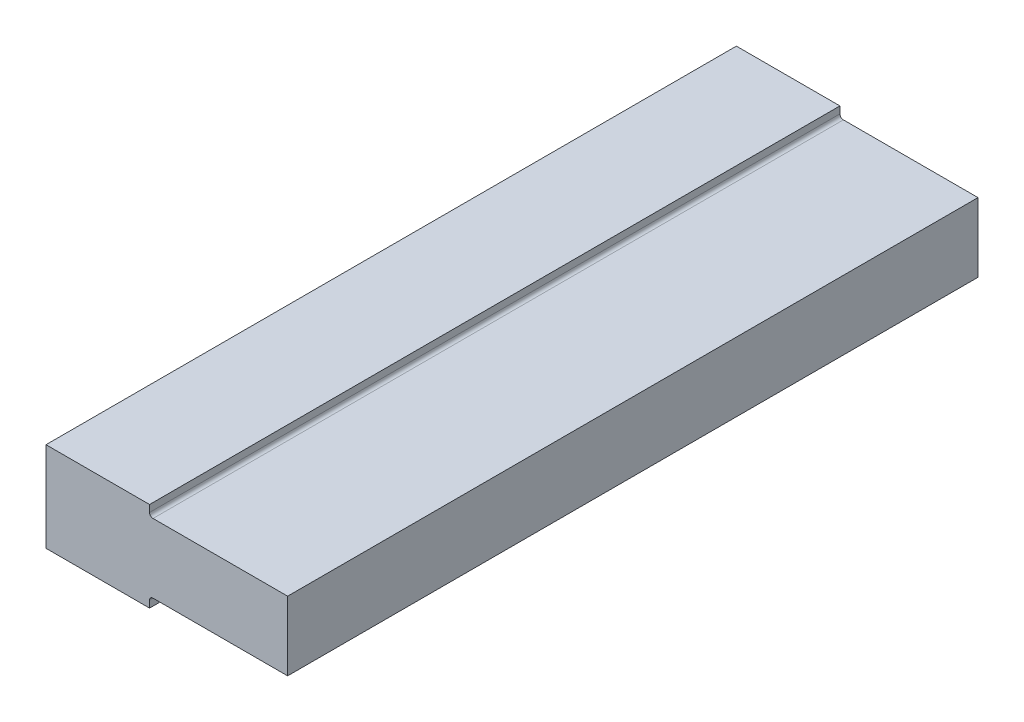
ISO-10303-21;
HEADER;
FILE_DESCRIPTION(('STEP AP214'),'2;1');
FILE_NAME('part.step','',(''),(''),'','','');
FILE_SCHEMA(('AUTOMOTIVE_DESIGN { 1 0 10303 214 1 1 1 1 }'));
ENDSEC;
DATA;
#1=APPLICATION_CONTEXT('core data for automotive mechanical design processes');
#2=APPLICATION_PROTOCOL_DEFINITION('international standard','automotive_design',2000,#1);
#3=PRODUCT_CONTEXT('',#1,'mechanical');
#4=PRODUCT('Part','Part','',(#3));
#5=PRODUCT_RELATED_PRODUCT_CATEGORY('part','',(#4));
#6=PRODUCT_DEFINITION_FORMATION('','',#4);
#7=PRODUCT_DEFINITION_CONTEXT('part definition',#1,'design');
#8=PRODUCT_DEFINITION('design','',#6,#7);
#9=PRODUCT_DEFINITION_SHAPE('','',#8);
#10=(LENGTH_UNIT() NAMED_UNIT(*) SI_UNIT(.MILLI.,.METRE.));
#11=(NAMED_UNIT(*) PLANE_ANGLE_UNIT() SI_UNIT($,.RADIAN.));
#12=(NAMED_UNIT(*) SI_UNIT($,.STERADIAN.) SOLID_ANGLE_UNIT());
#13=UNCERTAINTY_MEASURE_WITH_UNIT(LENGTH_MEASURE(1.E-05),#10,'distance_accuracy_value','');
#14=(GEOMETRIC_REPRESENTATION_CONTEXT(3) GLOBAL_UNCERTAINTY_ASSIGNED_CONTEXT((#13)) GLOBAL_UNIT_ASSIGNED_CONTEXT((#10,
#11,#12)) REPRESENTATION_CONTEXT('',''));
#15=CARTESIAN_POINT('',(0.,0.,0.));
#16=DIRECTION('',(0.,0.,1.));
#17=DIRECTION('',(1.,0.,0.));
#18=AXIS2_PLACEMENT_3D('',#15,#16,#17);
#19=CARTESIAN_POINT('',(0.,-6.50000000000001,100.));
#20=DIRECTION('',(0.,1.,0.));
#21=DIRECTION('',(0.,0.,1.));
#22=AXIS2_PLACEMENT_3D('',#19,#20,#21);
#23=PLANE('',#22);
#24=DIRECTION('',(1.,0.,0.));
#25=VECTOR('',#24,1.);
#26=CARTESIAN_POINT('',(0.,-6.50000000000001,0.));
#27=LINE('',#26,#25);
#28=CARTESIAN_POINT('',(0.,-6.50000000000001,0.));
#29=VERTEX_POINT('',#28);
#30=CARTESIAN_POINT('',(15.,-6.50000000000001,0.));
#31=VERTEX_POINT('',#30);
#32=EDGE_CURVE('E147',#29,#31,#27,.T.);
#33=ORIENTED_EDGE('',*,*,#32,.T.);
#34=DIRECTION('',(0.,0.,-1.));
#35=VECTOR('',#34,1.);
#36=CARTESIAN_POINT('',(15.,-6.50000000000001,100.));
#37=LINE('',#36,#35);
#38=CARTESIAN_POINT('',(15.,-6.50000000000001,100.));
#39=VERTEX_POINT('',#38);
#40=EDGE_CURVE('E12',#39,#31,#37,.T.);
#41=ORIENTED_EDGE('',*,*,#40,.F.);
#42=DIRECTION('',(1.,0.,0.));
#43=VECTOR('',#42,1.);
#44=CARTESIAN_POINT('',(0.,-6.50000000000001,100.));
#45=LINE('',#44,#43);
#46=CARTESIAN_POINT('',(0.,-6.50000000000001,100.));
#47=VERTEX_POINT('',#46);
#48=EDGE_CURVE('E165',#47,#39,#45,.T.);
#49=ORIENTED_EDGE('',*,*,#48,.F.);
#50=DIRECTION('',(0.,0.,-1.));
#51=VECTOR('',#50,1.);
#52=CARTESIAN_POINT('',(0.,-6.50000000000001,100.));
#53=LINE('',#52,#51);
#54=EDGE_CURVE('E143',#47,#29,#53,.T.);
#55=ORIENTED_EDGE('',*,*,#54,.T.);
#56=EDGE_LOOP('',(#33,#41,#49,#55));
#57=FACE_BOUND('',#56,.T.);
#58=ADVANCED_FACE('F39',(#57),#23,.F.);
#59=CARTESIAN_POINT('',(15.,-6.50000000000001,100.));
#60=DIRECTION('',(-1.,0.,0.));
#61=DIRECTION('',(0.,0.,1.));
#62=AXIS2_PLACEMENT_3D('',#59,#60,#61);
#63=PLANE('',#62);
#64=DIRECTION('',(0.,1.,0.));
#65=VECTOR('',#64,1.);
#66=CARTESIAN_POINT('',(15.,-6.50000000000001,0.));
#67=LINE('',#66,#65);
#68=CARTESIAN_POINT('',(15.,-5.5,0.));
#69=VERTEX_POINT('',#68);
#70=EDGE_CURVE('E150',#31,#69,#67,.T.);
#71=ORIENTED_EDGE('',*,*,#70,.T.);
#72=DIRECTION('',(0.,0.,-1.));
#73=VECTOR('',#72,1.);
#74=CARTESIAN_POINT('',(15.,-5.5,100.));
#75=LINE('',#74,#73);
#76=CARTESIAN_POINT('',(15.,-5.5,100.));
#77=VERTEX_POINT('',#76);
#78=EDGE_CURVE('E47',#77,#69,#75,.T.);
#79=ORIENTED_EDGE('',*,*,#78,.F.);
#80=DIRECTION('',(0.,1.,0.));
#81=VECTOR('',#80,1.);
#82=CARTESIAN_POINT('',(15.,-6.50000000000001,100.));
#83=LINE('',#82,#81);
#84=EDGE_CURVE('E104',#39,#77,#83,.T.);
#85=ORIENTED_EDGE('',*,*,#84,.F.);
#86=ORIENTED_EDGE('',*,*,#40,.T.);
#87=EDGE_LOOP('',(#71,#79,#85,#86));
#88=FACE_BOUND('',#87,.T.);
#89=ADVANCED_FACE('F187',(#88),#63,.F.);
#90=CARTESIAN_POINT('',(15.5,-5.5,100.));
#91=DIRECTION('',(0.,0.,-1.));
#92=DIRECTION('',(-1.,0.,0.));
#93=AXIS2_PLACEMENT_3D('',#90,#91,#92);
#94=CYLINDRICAL_SURFACE('',#93,0.5);
#95=CARTESIAN_POINT('',(15.5,-5.5,0.));
#96=DIRECTION('',(0.,0.,-1.));
#97=DIRECTION('',(1.,0.,0.));
#98=AXIS2_PLACEMENT_3D('',#95,#96,#97);
#99=CIRCLE('',#98,0.5);
#100=CARTESIAN_POINT('',(15.5,-5.,0.));
#101=VERTEX_POINT('',#100);
#102=EDGE_CURVE('E152',#69,#101,#99,.T.);
#103=ORIENTED_EDGE('',*,*,#102,.T.);
#104=DIRECTION('',(0.,0.,-1.));
#105=VECTOR('',#104,1.);
#106=CARTESIAN_POINT('',(15.5,-5.,100.));
#107=LINE('',#106,#105);
#108=CARTESIAN_POINT('',(15.5,-5.,100.));
#109=VERTEX_POINT('',#108);
#110=EDGE_CURVE('E196',#109,#101,#107,.T.);
#111=ORIENTED_EDGE('',*,*,#110,.F.);
#112=CARTESIAN_POINT('',(15.5,-5.5,100.));
#113=DIRECTION('',(0.,0.,-1.));
#114=DIRECTION('',(1.,0.,0.));
#115=AXIS2_PLACEMENT_3D('',#112,#113,#114);
#116=CIRCLE('',#115,0.5);
#117=EDGE_CURVE('E180',#77,#109,#116,.T.);
#118=ORIENTED_EDGE('',*,*,#117,.F.);
#119=ORIENTED_EDGE('',*,*,#78,.T.);
#120=EDGE_LOOP('',(#103,#111,#118,#119));
#121=FACE_BOUND('',#120,.T.);
#122=ADVANCED_FACE('F193',(#121),#94,.F.);
#123=CARTESIAN_POINT('',(15.5,-5.,100.));
#124=DIRECTION('',(0.,1.,0.));
#125=DIRECTION('',(0.,0.,1.));
#126=AXIS2_PLACEMENT_3D('',#123,#124,#125);
#127=PLANE('',#126);
#128=DIRECTION('',(1.,0.,0.));
#129=VECTOR('',#128,1.);
#130=CARTESIAN_POINT('',(15.5,-5.,0.));
#131=LINE('',#130,#129);
#132=CARTESIAN_POINT('',(35.,-5.,0.));
#133=VERTEX_POINT('',#132);
#134=EDGE_CURVE('E154',#101,#133,#131,.T.);
#135=ORIENTED_EDGE('',*,*,#134,.T.);
#136=DIRECTION('',(0.,0.,-1.));
#137=VECTOR('',#136,1.);
#138=CARTESIAN_POINT('',(35.,-5.,100.));
#139=LINE('',#138,#137);
#140=CARTESIAN_POINT('',(35.,-5.,100.));
#141=VERTEX_POINT('',#140);
#142=EDGE_CURVE('E206',#141,#133,#139,.T.);
#143=ORIENTED_EDGE('',*,*,#142,.F.);
#144=DIRECTION('',(1.,0.,0.));
#145=VECTOR('',#144,1.);
#146=CARTESIAN_POINT('',(15.5,-5.,100.));
#147=LINE('',#146,#145);
#148=EDGE_CURVE('E178',#109,#141,#147,.T.);
#149=ORIENTED_EDGE('',*,*,#148,.F.);
#150=ORIENTED_EDGE('',*,*,#110,.T.);
#151=EDGE_LOOP('',(#135,#143,#149,#150));
#152=FACE_BOUND('',#151,.T.);
#153=ADVANCED_FACE('F204',(#152),#127,.F.);
#154=CARTESIAN_POINT('',(35.,-5.,100.));
#155=DIRECTION('',(-1.,0.,0.));
#156=DIRECTION('',(0.,0.,1.));
#157=AXIS2_PLACEMENT_3D('',#154,#155,#156);
#158=PLANE('',#157);
#159=DIRECTION('',(0.,1.,0.));
#160=VECTOR('',#159,1.);
#161=CARTESIAN_POINT('',(35.,-5.,0.));
#162=LINE('',#161,#160);
#163=CARTESIAN_POINT('',(35.,5.,0.));
#164=VERTEX_POINT('',#163);
#165=EDGE_CURVE('E156',#133,#164,#162,.T.);
#166=ORIENTED_EDGE('',*,*,#165,.T.);
#167=DIRECTION('',(0.,0.,-1.));
#168=VECTOR('',#167,1.);
#169=CARTESIAN_POINT('',(35.,5.,100.));
#170=LINE('',#169,#168);
#171=CARTESIAN_POINT('',(35.,5.,100.));
#172=VERTEX_POINT('',#171);
#173=EDGE_CURVE('E212',#172,#164,#170,.T.);
#174=ORIENTED_EDGE('',*,*,#173,.F.);
#175=DIRECTION('',(0.,1.,0.));
#176=VECTOR('',#175,1.);
#177=CARTESIAN_POINT('',(35.,-5.,100.));
#178=LINE('',#177,#176);
#179=EDGE_CURVE('E176',#141,#172,#178,.T.);
#180=ORIENTED_EDGE('',*,*,#179,.F.);
#181=ORIENTED_EDGE('',*,*,#142,.T.);
#182=EDGE_LOOP('',(#166,#174,#180,#181));
#183=FACE_BOUND('',#182,.T.);
#184=ADVANCED_FACE('F209',(#183),#158,.F.);
#185=CARTESIAN_POINT('',(15.5,5.,100.));
#186=DIRECTION('',(0.,-1.,0.));
#187=DIRECTION('',(0.,0.,-1.));
#188=AXIS2_PLACEMENT_3D('',#185,#186,#187);
#189=PLANE('',#188);
#190=DIRECTION('',(-1.,0.,0.));
#191=VECTOR('',#190,1.);
#192=CARTESIAN_POINT('',(15.5,5.,0.));
#193=LINE('',#192,#191);
#194=CARTESIAN_POINT('',(15.5,5.,0.));
#195=VERTEX_POINT('',#194);
#196=EDGE_CURVE('E158',#164,#195,#193,.T.);
#197=ORIENTED_EDGE('',*,*,#196,.T.);
#198=DIRECTION('',(0.,0.,-1.));
#199=VECTOR('',#198,1.);
#200=CARTESIAN_POINT('',(15.5,5.,100.));
#201=LINE('',#200,#199);
#202=CARTESIAN_POINT('',(15.5,5.,100.));
#203=VERTEX_POINT('',#202);
#204=EDGE_CURVE('E214',#203,#195,#201,.T.);
#205=ORIENTED_EDGE('',*,*,#204,.F.);
#206=DIRECTION('',(-1.,0.,0.));
#207=VECTOR('',#206,1.);
#208=CARTESIAN_POINT('',(15.5,5.,100.));
#209=LINE('',#208,#207);
#210=EDGE_CURVE('E173',#172,#203,#209,.T.);
#211=ORIENTED_EDGE('',*,*,#210,.F.);
#212=ORIENTED_EDGE('',*,*,#173,.T.);
#213=EDGE_LOOP('',(#197,#205,#211,#212));
#214=FACE_BOUND('',#213,.T.);
#215=ADVANCED_FACE('F225',(#214),#189,.F.);
#216=CARTESIAN_POINT('',(15.5,5.5,100.));
#217=DIRECTION('',(0.,0.,-1.));
#218=DIRECTION('',(-1.,0.,0.));
#219=AXIS2_PLACEMENT_3D('',#216,#217,#218);
#220=CYLINDRICAL_SURFACE('',#219,0.5);
#221=CARTESIAN_POINT('',(15.5,5.5,0.));
#222=DIRECTION('',(0.,0.,-1.));
#223=DIRECTION('',(-1.,0.,0.));
#224=AXIS2_PLACEMENT_3D('',#221,#222,#223);
#225=CIRCLE('',#224,0.5);
#226=CARTESIAN_POINT('',(15.,5.5,0.));
#227=VERTEX_POINT('',#226);
#228=EDGE_CURVE('E160',#195,#227,#225,.T.);
#229=ORIENTED_EDGE('',*,*,#228,.T.);
#230=DIRECTION('',(0.,0.,-1.));
#231=VECTOR('',#230,1.);
#232=CARTESIAN_POINT('',(15.,5.5,100.));
#233=LINE('',#232,#231);
#234=CARTESIAN_POINT('',(15.,5.5,100.));
#235=VERTEX_POINT('',#234);
#236=EDGE_CURVE('E138',#235,#227,#233,.T.);
#237=ORIENTED_EDGE('',*,*,#236,.F.);
#238=CARTESIAN_POINT('',(15.5,5.5,100.));
#239=DIRECTION('',(0.,0.,-1.));
#240=DIRECTION('',(-1.,0.,0.));
#241=AXIS2_PLACEMENT_3D('',#238,#239,#240);
#242=CIRCLE('',#241,0.5);
#243=EDGE_CURVE('E129',#203,#235,#242,.T.);
#244=ORIENTED_EDGE('',*,*,#243,.F.);
#245=ORIENTED_EDGE('',*,*,#204,.T.);
#246=EDGE_LOOP('',(#229,#237,#244,#245));
#247=FACE_BOUND('',#246,.T.);
#248=ADVANCED_FACE('F221',(#247),#220,.F.);
#249=CARTESIAN_POINT('',(15.,6.5,100.));
#250=DIRECTION('',(-1.,0.,0.));
#251=DIRECTION('',(0.,0.,1.));
#252=AXIS2_PLACEMENT_3D('',#249,#250,#251);
#253=PLANE('',#252);
#254=DIRECTION('',(0.,1.,0.));
#255=VECTOR('',#254,1.);
#256=CARTESIAN_POINT('',(15.,6.5,0.));
#257=LINE('',#256,#255);
#258=CARTESIAN_POINT('',(15.,6.5,0.));
#259=VERTEX_POINT('',#258);
#260=EDGE_CURVE('E137',#227,#259,#257,.T.);
#261=ORIENTED_EDGE('',*,*,#260,.T.);
#262=DIRECTION('',(0.,0.,-1.));
#263=VECTOR('',#262,1.);
#264=CARTESIAN_POINT('',(15.,6.5,100.));
#265=LINE('',#264,#263);
#266=CARTESIAN_POINT('',(15.,6.5,100.));
#267=VERTEX_POINT('',#266);
#268=EDGE_CURVE('E134',#267,#259,#265,.T.);
#269=ORIENTED_EDGE('',*,*,#268,.F.);
#270=DIRECTION('',(0.,1.,0.));
#271=VECTOR('',#270,1.);
#272=CARTESIAN_POINT('',(15.,6.5,100.));
#273=LINE('',#272,#271);
#274=EDGE_CURVE('E123',#235,#267,#273,.T.);
#275=ORIENTED_EDGE('',*,*,#274,.F.);
#276=ORIENTED_EDGE('',*,*,#236,.T.);
#277=EDGE_LOOP('',(#261,#269,#275,#276));
#278=FACE_BOUND('',#277,.T.);
#279=ADVANCED_FACE('F135',(#278),#253,.F.);
#280=CARTESIAN_POINT('',(0.,6.5,100.));
#281=DIRECTION('',(0.,-1.,0.));
#282=DIRECTION('',(0.,0.,-1.));
#283=AXIS2_PLACEMENT_3D('',#280,#281,#282);
#284=PLANE('',#283);
#285=DIRECTION('',(-1.,0.,0.));
#286=VECTOR('',#285,1.);
#287=CARTESIAN_POINT('',(0.,6.5,0.));
#288=LINE('',#287,#286);
#289=CARTESIAN_POINT('',(0.,6.5,0.));
#290=VERTEX_POINT('',#289);
#291=EDGE_CURVE('E90',#259,#290,#288,.T.);
#292=ORIENTED_EDGE('',*,*,#291,.T.);
#293=DIRECTION('',(0.,0.,-1.));
#294=VECTOR('',#293,1.);
#295=CARTESIAN_POINT('',(0.,6.5,100.));
#296=LINE('',#295,#294);
#297=CARTESIAN_POINT('',(0.,6.5,100.));
#298=VERTEX_POINT('',#297);
#299=EDGE_CURVE('E139',#298,#290,#296,.T.);
#300=ORIENTED_EDGE('',*,*,#299,.F.);
#301=DIRECTION('',(-1.,0.,0.));
#302=VECTOR('',#301,1.);
#303=CARTESIAN_POINT('',(0.,6.5,100.));
#304=LINE('',#303,#302);
#305=EDGE_CURVE('E127',#267,#298,#304,.T.);
#306=ORIENTED_EDGE('',*,*,#305,.F.);
#307=ORIENTED_EDGE('',*,*,#268,.T.);
#308=EDGE_LOOP('',(#292,#300,#306,#307));
#309=FACE_BOUND('',#308,.T.);
#310=ADVANCED_FACE('F141',(#309),#284,.F.);
#311=CARTESIAN_POINT('',(0.,-6.50000000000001,100.));
#312=DIRECTION('',(1.,0.,0.));
#313=DIRECTION('',(0.,0.,-1.));
#314=AXIS2_PLACEMENT_3D('',#311,#312,#313);
#315=PLANE('',#314);
#316=DIRECTION('',(0.,-1.,0.));
#317=VECTOR('',#316,1.);
#318=CARTESIAN_POINT('',(0.,-6.50000000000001,0.));
#319=LINE('',#318,#317);
#320=EDGE_CURVE('E96',#290,#29,#319,.T.);
#321=ORIENTED_EDGE('',*,*,#320,.T.);
#322=ORIENTED_EDGE('',*,*,#54,.F.);
#323=DIRECTION('',(0.,-1.,0.));
#324=VECTOR('',#323,1.);
#325=CARTESIAN_POINT('',(0.,-6.50000000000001,100.));
#326=LINE('',#325,#324);
#327=EDGE_CURVE('E55',#298,#47,#326,.T.);
#328=ORIENTED_EDGE('',*,*,#327,.F.);
#329=ORIENTED_EDGE('',*,*,#299,.T.);
#330=EDGE_LOOP('',(#321,#322,#328,#329));
#331=FACE_BOUND('',#330,.T.);
#332=ADVANCED_FACE('F279',(#331),#315,.F.);
#333=CARTESIAN_POINT('',(15.5,-5.5,100.));
#334=DIRECTION('',(0.,0.,1.));
#335=DIRECTION('',(1.,0.,0.));
#336=AXIS2_PLACEMENT_3D('',#333,#334,#335);
#337=PLANE('',#336);
#338=ORIENTED_EDGE('',*,*,#48,.T.);
#339=ORIENTED_EDGE('',*,*,#84,.T.);
#340=ORIENTED_EDGE('',*,*,#117,.T.);
#341=ORIENTED_EDGE('',*,*,#148,.T.);
#342=ORIENTED_EDGE('',*,*,#179,.T.);
#343=ORIENTED_EDGE('',*,*,#210,.T.);
#344=ORIENTED_EDGE('',*,*,#243,.T.);
#345=ORIENTED_EDGE('',*,*,#274,.T.);
#346=ORIENTED_EDGE('',*,*,#305,.T.);
#347=ORIENTED_EDGE('',*,*,#327,.T.);
#348=EDGE_LOOP('',(#338,#339,#340,#341,#342,#343,#344,#345,#346,#347));
#349=FACE_BOUND('',#348,.T.);
#350=ADVANCED_FACE('F125',(#349),#337,.T.);
#351=CARTESIAN_POINT('',(15.5,-5.5,0.));
#352=DIRECTION('',(0.,0.,1.));
#353=DIRECTION('',(1.,0.,0.));
#354=AXIS2_PLACEMENT_3D('',#351,#352,#353);
#355=PLANE('',#354);
#356=ORIENTED_EDGE('',*,*,#32,.F.);
#357=ORIENTED_EDGE('',*,*,#320,.F.);
#358=ORIENTED_EDGE('',*,*,#291,.F.);
#359=ORIENTED_EDGE('',*,*,#260,.F.);
#360=ORIENTED_EDGE('',*,*,#228,.F.);
#361=ORIENTED_EDGE('',*,*,#196,.F.);
#362=ORIENTED_EDGE('',*,*,#165,.F.);
#363=ORIENTED_EDGE('',*,*,#134,.F.);
#364=ORIENTED_EDGE('',*,*,#102,.F.);
#365=ORIENTED_EDGE('',*,*,#70,.F.);
#366=EDGE_LOOP('',(#356,#357,#358,#359,#360,#361,#362,#363,#364,#365));
#367=FACE_BOUND('',#366,.T.);
#368=ADVANCED_FACE('F198',(#367),#355,.F.);
#369=CLOSED_SHELL('',(#58,#89,#122,#153,#184,#215,#248,#279,#310,#332,#350,#368));
#370=MANIFOLD_SOLID_BREP('B2',#369);
#371=ADVANCED_BREP_SHAPE_REPRESENTATION('',(#18,#370),#14);
#372=SHAPE_DEFINITION_REPRESENTATION(#9,#371);
ENDSEC;
END-ISO-10303-21;
